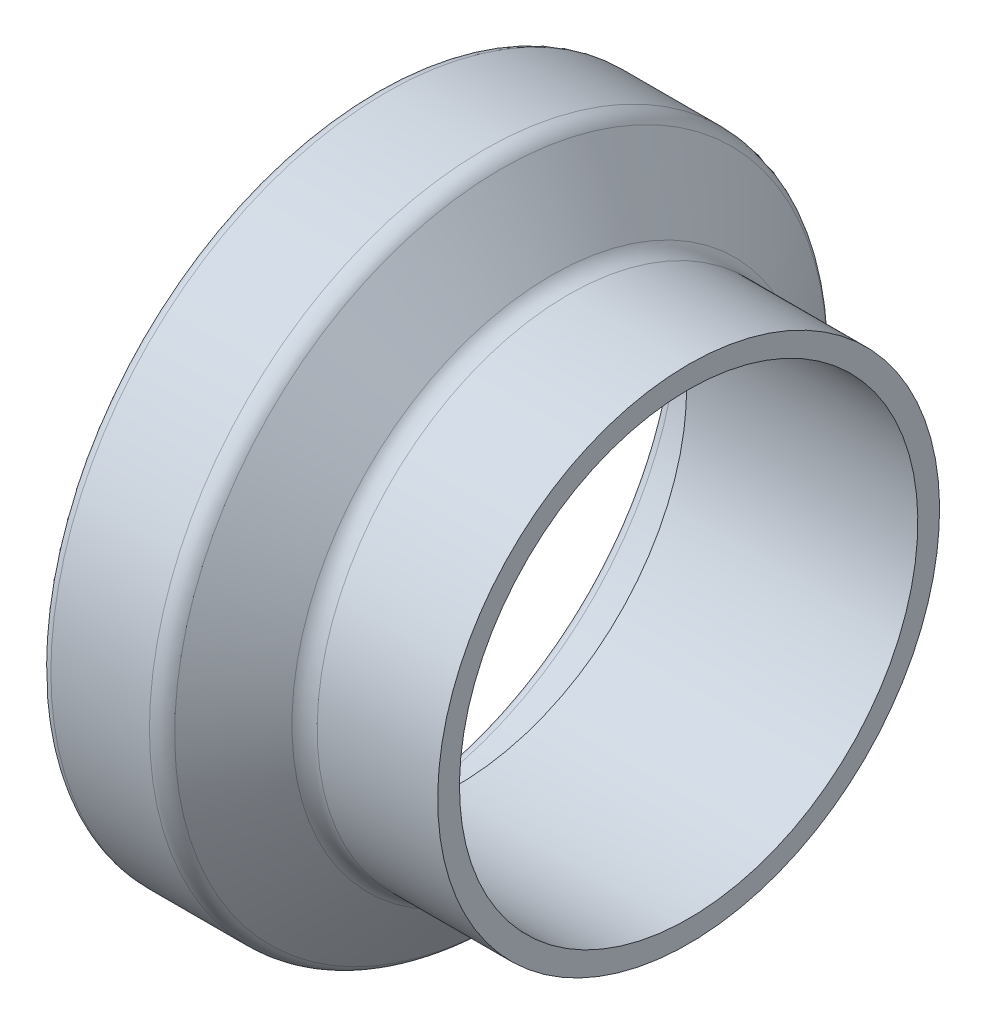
from build123d import *


with BuildPart() as part:
    # Sketch1 → Revolve1 (revolve)
    with BuildSketch(Plane.XY):
        with BuildLine():
            Line((-8.230583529, 17.399), (-25.781983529, 17.399))
            Line((-25.781983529, 17.399), (-25.781983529, 21.4503))
            ThreePointArc((-25.781983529, 21.4503), (-26.020047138, 22.025036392), (-26.594783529, 22.2631))
            Line((-26.594783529, 22.2631), (-31.242983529, 22.2631))
            ThreePointArc((-31.242983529, 22.2631), (-31.817719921, 22.501163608), (-32.055783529, 23.0759))
            Line((-32.055783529, 23.0759), (-32.055783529, 24.5872))
            ThreePointArc((-32.055783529, 24.5872), (-31.817719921, 25.161936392), (-31.242983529, 25.4))
            Line((-31.242983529, 25.4), (-23.760413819, 25.4))
            ThreePointArc((-23.760413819, 25.4), (-23.046408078, 25.231873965), (-22.482437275, 24.7628244))
            Line((-22.482437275, 24.7628244), (-18.657661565, 19.6871756))
            ThreePointArc((-18.657661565, 19.6871756), (-18.093690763, 19.218126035), (-17.379685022, 19.05))
            Line((-17.379685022, 19.05), (-8.230583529, 19.05))
            Line((-8.230583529, 19.05), (-8.230583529, 17.399))
        make_face()
    revolve(axis=Axis((0, 0, 0), (-1, 0, 0)))


solid = part.part
